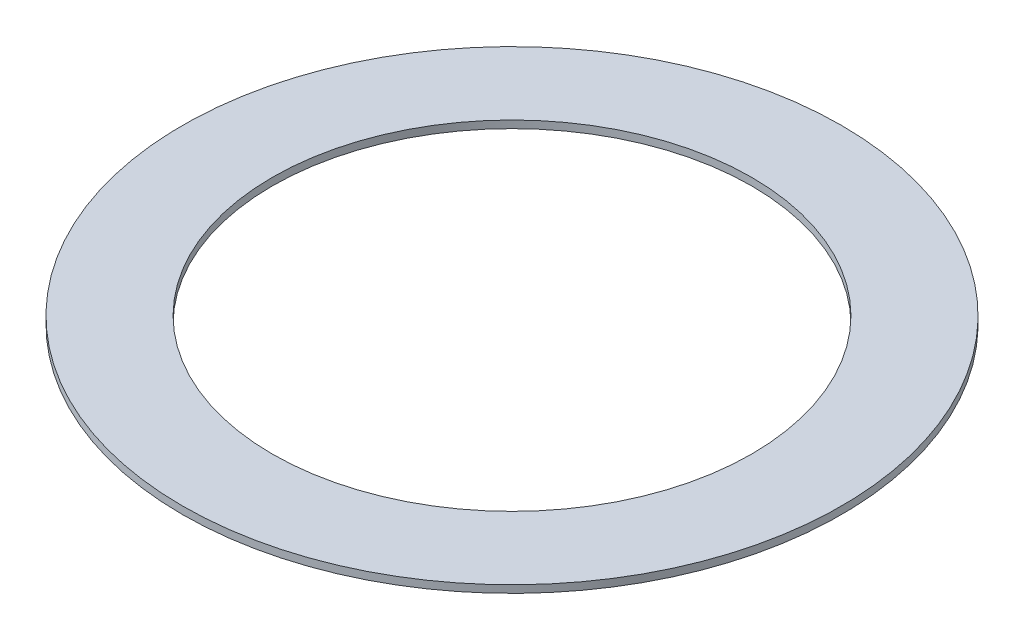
from build123d import *

# Parameters (mm, degrees)
SKETCH1_R           = 34.925
SKETCH1_R_2         = 25.4
BOSS_EXTRUDE1_DEPTH = 0.79375


with BuildPart() as part:
    # Sketch1 → Boss-Extrude1 (new body)
    with BuildSketch(Plane(origin=(0, 0, 0), x_dir=(1, 0, 0), z_dir=(0, 1, 0))):
        with Locations(Location((0, 0, 0), (0, 0, 270))):
            Circle(SKETCH1_R)
        with Locations(Location((0, 0, 0), (0, 0, 270))):
            Circle(SKETCH1_R_2, mode=Mode.SUBTRACT)
    extrude(amount=BOSS_EXTRUDE1_DEPTH)


solid = part.part
